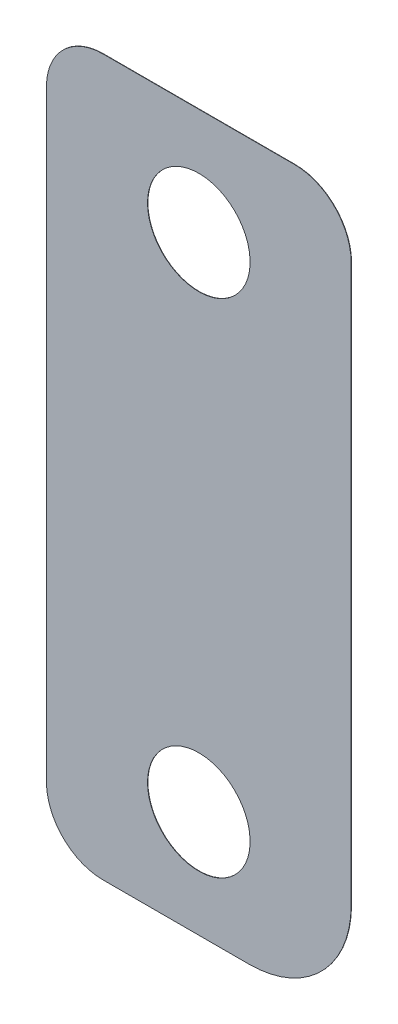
ISO-10303-21;
HEADER;
FILE_DESCRIPTION(('STEP AP214'),'2;1');
FILE_NAME('part.step','',(''),(''),'','','');
FILE_SCHEMA(('AUTOMOTIVE_DESIGN { 1 0 10303 214 1 1 1 1 }'));
ENDSEC;
DATA;
#1=APPLICATION_CONTEXT('core data for automotive mechanical design processes');
#2=APPLICATION_PROTOCOL_DEFINITION('international standard','automotive_design',2000,#1);
#3=PRODUCT_CONTEXT('',#1,'mechanical');
#4=PRODUCT('Part','Part','',(#3));
#5=PRODUCT_RELATED_PRODUCT_CATEGORY('part','',(#4));
#6=PRODUCT_DEFINITION_FORMATION('','',#4);
#7=PRODUCT_DEFINITION_CONTEXT('part definition',#1,'design');
#8=PRODUCT_DEFINITION('design','',#6,#7);
#9=PRODUCT_DEFINITION_SHAPE('','',#8);
#10=(LENGTH_UNIT() NAMED_UNIT(*) SI_UNIT(.MILLI.,.METRE.));
#11=(NAMED_UNIT(*) PLANE_ANGLE_UNIT() SI_UNIT($,.RADIAN.));
#12=(NAMED_UNIT(*) SI_UNIT($,.STERADIAN.) SOLID_ANGLE_UNIT());
#13=UNCERTAINTY_MEASURE_WITH_UNIT(LENGTH_MEASURE(1.E-05),#10,'distance_accuracy_value','');
#14=(GEOMETRIC_REPRESENTATION_CONTEXT(3) GLOBAL_UNCERTAINTY_ASSIGNED_CONTEXT((#13)) GLOBAL_UNIT_ASSIGNED_CONTEXT((#10,
#11,#12)) REPRESENTATION_CONTEXT('',''));
#15=CARTESIAN_POINT('',(0.,0.,0.));
#16=DIRECTION('',(0.,0.,1.));
#17=DIRECTION('',(1.,0.,0.));
#18=AXIS2_PLACEMENT_3D('',#15,#16,#17);
#19=CARTESIAN_POINT('',(-767.746295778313,-9.99540627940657,71.9582));
#20=DIRECTION('',(0.,0.,-1.));
#21=DIRECTION('',(-1.,0.,0.));
#22=AXIS2_PLACEMENT_3D('',#19,#20,#21);
#23=CYLINDRICAL_SURFACE('',#22,3.93700000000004);
#24=CARTESIAN_POINT('',(-767.746295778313,-9.99540627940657,71.9328));
#25=DIRECTION('',(0.,0.,-1.));
#26=DIRECTION('',(-1.,0.,0.));
#27=AXIS2_PLACEMENT_3D('',#24,#25,#26);
#28=CIRCLE('',#27,3.93700000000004);
#29=CARTESIAN_POINT('',(-771.683295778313,-9.99540627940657,71.9328));
#30=VERTEX_POINT('',#29);
#31=CARTESIAN_POINT('',(-767.746295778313,-6.05840627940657,71.9328));
#32=VERTEX_POINT('',#31);
#33=EDGE_CURVE('E149',#30,#32,#28,.T.);
#34=ORIENTED_EDGE('',*,*,#33,.F.);
#35=DIRECTION('',(0.,0.,-1.));
#36=VECTOR('',#35,1.);
#37=CARTESIAN_POINT('',(-771.683295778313,-9.99540627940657,71.9582));
#38=LINE('',#37,#36);
#39=CARTESIAN_POINT('',(-771.683295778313,-9.99540627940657,71.9582));
#40=VERTEX_POINT('',#39);
#41=EDGE_CURVE('E11',#40,#30,#38,.T.);
#42=ORIENTED_EDGE('',*,*,#41,.F.);
#43=CARTESIAN_POINT('',(-767.746295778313,-9.99540627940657,71.9582));
#44=DIRECTION('',(0.,0.,-1.));
#45=DIRECTION('',(-1.,0.,0.));
#46=AXIS2_PLACEMENT_3D('',#43,#44,#45);
#47=CIRCLE('',#46,3.93700000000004);
#48=CARTESIAN_POINT('',(-767.746295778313,-6.05840627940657,71.9582));
#49=VERTEX_POINT('',#48);
#50=EDGE_CURVE('E178',#40,#49,#47,.T.);
#51=ORIENTED_EDGE('',*,*,#50,.T.);
#52=DIRECTION('',(0.,0.,-1.));
#53=VECTOR('',#52,1.);
#54=CARTESIAN_POINT('',(-767.746295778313,-6.05840627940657,71.9582));
#55=LINE('',#54,#53);
#56=EDGE_CURVE('E48',#49,#32,#55,.T.);
#57=ORIENTED_EDGE('',*,*,#56,.T.);
#58=EDGE_LOOP('',(#34,#42,#51,#57));
#59=FACE_BOUND('',#58,.T.);
#60=ADVANCED_FACE('F45',(#59),#23,.T.);
#61=CARTESIAN_POINT('',(-771.683295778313,-51.9054062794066,71.9582));
#62=DIRECTION('',(-1.,0.,0.));
#63=DIRECTION('',(0.,0.,1.));
#64=AXIS2_PLACEMENT_3D('',#61,#62,#63);
#65=PLANE('',#64);
#66=DIRECTION('',(0.,1.,0.));
#67=VECTOR('',#66,1.);
#68=CARTESIAN_POINT('',(-771.683295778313,-51.9054062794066,71.9328));
#69=LINE('',#68,#67);
#70=CARTESIAN_POINT('',(-771.683295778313,-51.9054062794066,71.9328));
#71=VERTEX_POINT('',#70);
#72=EDGE_CURVE('E175',#71,#30,#69,.T.);
#73=ORIENTED_EDGE('',*,*,#72,.F.);
#74=DIRECTION('',(0.,0.,-1.));
#75=VECTOR('',#74,1.);
#76=CARTESIAN_POINT('',(-771.683295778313,-51.9054062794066,71.9582));
#77=LINE('',#76,#75);
#78=CARTESIAN_POINT('',(-771.683295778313,-51.9054062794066,71.9582));
#79=VERTEX_POINT('',#78);
#80=EDGE_CURVE('E55',#79,#71,#77,.T.);
#81=ORIENTED_EDGE('',*,*,#80,.F.);
#82=DIRECTION('',(0.,1.,0.));
#83=VECTOR('',#82,1.);
#84=CARTESIAN_POINT('',(-771.683295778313,-51.9054062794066,71.9582));
#85=LINE('',#84,#83);
#86=EDGE_CURVE('E134',#79,#40,#85,.T.);
#87=ORIENTED_EDGE('',*,*,#86,.T.);
#88=ORIENTED_EDGE('',*,*,#41,.T.);
#89=EDGE_LOOP('',(#73,#81,#87,#88));
#90=FACE_BOUND('',#89,.T.);
#91=ADVANCED_FACE('F198',(#90),#65,.T.);
#92=CARTESIAN_POINT('',(-767.746295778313,-51.9054062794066,71.9582));
#93=DIRECTION('',(0.,0.,-1.));
#94=DIRECTION('',(-1.,0.,0.));
#95=AXIS2_PLACEMENT_3D('',#92,#93,#94);
#96=CYLINDRICAL_SURFACE('',#95,3.93700000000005);
#97=CARTESIAN_POINT('',(-767.746295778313,-51.9054062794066,71.9328));
#98=DIRECTION('',(0.,0.,-1.));
#99=DIRECTION('',(-1.,0.,0.));
#100=AXIS2_PLACEMENT_3D('',#97,#98,#99);
#101=CIRCLE('',#100,3.93700000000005);
#102=CARTESIAN_POINT('',(-767.746295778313,-55.8424062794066,71.9328));
#103=VERTEX_POINT('',#102);
#104=EDGE_CURVE('E120',#103,#71,#101,.T.);
#105=ORIENTED_EDGE('',*,*,#104,.F.);
#106=DIRECTION('',(0.,0.,-1.));
#107=VECTOR('',#106,1.);
#108=CARTESIAN_POINT('',(-767.746295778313,-55.8424062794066,71.9582));
#109=LINE('',#108,#107);
#110=CARTESIAN_POINT('',(-767.746295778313,-55.8424062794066,71.9582));
#111=VERTEX_POINT('',#110);
#112=EDGE_CURVE('E115',#111,#103,#109,.T.);
#113=ORIENTED_EDGE('',*,*,#112,.F.);
#114=CARTESIAN_POINT('',(-767.746295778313,-51.9054062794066,71.9582));
#115=DIRECTION('',(0.,0.,-1.));
#116=DIRECTION('',(-1.,0.,0.));
#117=AXIS2_PLACEMENT_3D('',#114,#115,#116);
#118=CIRCLE('',#117,3.93700000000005);
#119=EDGE_CURVE('E118',#111,#79,#118,.T.);
#120=ORIENTED_EDGE('',*,*,#119,.T.);
#121=ORIENTED_EDGE('',*,*,#80,.T.);
#122=EDGE_LOOP('',(#105,#113,#120,#121));
#123=FACE_BOUND('',#122,.T.);
#124=ADVANCED_FACE('F117',(#123),#96,.T.);
#125=CARTESIAN_POINT('',(-757.586295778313,-55.8424062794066,71.9582));
#126=DIRECTION('',(0.,-1.,0.));
#127=DIRECTION('',(1.,0.,0.));
#128=AXIS2_PLACEMENT_3D('',#125,#126,#127);
#129=PLANE('',#128);
#130=DIRECTION('',(-1.,0.,0.));
#131=VECTOR('',#130,1.);
#132=CARTESIAN_POINT('',(-757.586295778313,-55.8424062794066,71.9328));
#133=LINE('',#132,#131);
#134=CARTESIAN_POINT('',(-757.586295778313,-55.8424062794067,71.9328));
#135=VERTEX_POINT('',#134);
#136=EDGE_CURVE('E170',#135,#103,#133,.T.);
#137=ORIENTED_EDGE('',*,*,#136,.F.);
#138=DIRECTION('',(0.,0.,-1.));
#139=VECTOR('',#138,1.);
#140=CARTESIAN_POINT('',(-757.586295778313,-55.8424062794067,71.9582));
#141=LINE('',#140,#139);
#142=CARTESIAN_POINT('',(-757.586295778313,-55.8424062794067,71.9582));
#143=VERTEX_POINT('',#142);
#144=EDGE_CURVE('E126',#143,#135,#141,.T.);
#145=ORIENTED_EDGE('',*,*,#144,.F.);
#146=DIRECTION('',(-1.,0.,0.));
#147=VECTOR('',#146,1.);
#148=CARTESIAN_POINT('',(-757.586295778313,-55.8424062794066,71.9582));
#149=LINE('',#148,#147);
#150=EDGE_CURVE('E132',#143,#111,#149,.T.);
#151=ORIENTED_EDGE('',*,*,#150,.T.);
#152=ORIENTED_EDGE('',*,*,#112,.T.);
#153=EDGE_LOOP('',(#137,#145,#151,#152));
#154=FACE_BOUND('',#153,.T.);
#155=ADVANCED_FACE('F137',(#154),#129,.T.);
#156=CARTESIAN_POINT('',(-757.586295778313,-48.7304062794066,71.9582));
#157=DIRECTION('',(0.,0.,-1.));
#158=DIRECTION('',(-1.,0.,0.));
#159=AXIS2_PLACEMENT_3D('',#156,#157,#158);
#160=CYLINDRICAL_SURFACE('',#159,7.11200000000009);
#161=CARTESIAN_POINT('',(-757.586295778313,-48.7304062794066,71.9328));
#162=DIRECTION('',(0.,0.,-1.));
#163=DIRECTION('',(-1.,0.,0.));
#164=AXIS2_PLACEMENT_3D('',#161,#162,#163);
#165=CIRCLE('',#164,7.11200000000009);
#166=CARTESIAN_POINT('',(-750.474295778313,-48.7304062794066,71.9328));
#167=VERTEX_POINT('',#166);
#168=EDGE_CURVE('E166',#167,#135,#165,.T.);
#169=ORIENTED_EDGE('',*,*,#168,.F.);
#170=DIRECTION('',(0.,0.,-1.));
#171=VECTOR('',#170,1.);
#172=CARTESIAN_POINT('',(-750.474295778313,-48.7304062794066,71.9582));
#173=LINE('',#172,#171);
#174=CARTESIAN_POINT('',(-750.474295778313,-48.7304062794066,71.9582));
#175=VERTEX_POINT('',#174);
#176=EDGE_CURVE('E184',#175,#167,#173,.T.);
#177=ORIENTED_EDGE('',*,*,#176,.F.);
#178=CARTESIAN_POINT('',(-757.586295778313,-48.7304062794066,71.9582));
#179=DIRECTION('',(0.,0.,-1.));
#180=DIRECTION('',(-1.,0.,0.));
#181=AXIS2_PLACEMENT_3D('',#178,#179,#180);
#182=CIRCLE('',#181,7.11200000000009);
#183=EDGE_CURVE('E139',#175,#143,#182,.T.);
#184=ORIENTED_EDGE('',*,*,#183,.T.);
#185=ORIENTED_EDGE('',*,*,#144,.T.);
#186=EDGE_LOOP('',(#169,#177,#184,#185));
#187=FACE_BOUND('',#186,.T.);
#188=ADVANCED_FACE('F211',(#187),#160,.T.);
#189=CARTESIAN_POINT('',(-750.474295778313,-9.99540627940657,71.9582));
#190=DIRECTION('',(1.,0.,0.));
#191=DIRECTION('',(0.,1.,0.));
#192=AXIS2_PLACEMENT_3D('',#189,#190,#191);
#193=PLANE('',#192);
#194=DIRECTION('',(0.,-1.,0.));
#195=VECTOR('',#194,1.);
#196=CARTESIAN_POINT('',(-750.474295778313,-9.99540627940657,71.9328));
#197=LINE('',#196,#195);
#198=CARTESIAN_POINT('',(-750.474295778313,-9.99540627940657,71.9328));
#199=VERTEX_POINT('',#198);
#200=EDGE_CURVE('E162',#199,#167,#197,.T.);
#201=ORIENTED_EDGE('',*,*,#200,.F.);
#202=DIRECTION('',(0.,0.,-1.));
#203=VECTOR('',#202,1.);
#204=CARTESIAN_POINT('',(-750.474295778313,-9.99540627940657,71.9582));
#205=LINE('',#204,#203);
#206=CARTESIAN_POINT('',(-750.474295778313,-9.99540627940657,71.9582));
#207=VERTEX_POINT('',#206);
#208=EDGE_CURVE('E187',#207,#199,#205,.T.);
#209=ORIENTED_EDGE('',*,*,#208,.F.);
#210=DIRECTION('',(0.,-1.,0.));
#211=VECTOR('',#210,1.);
#212=CARTESIAN_POINT('',(-750.474295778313,-9.99540627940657,71.9582));
#213=LINE('',#212,#211);
#214=EDGE_CURVE('E143',#207,#175,#213,.T.);
#215=ORIENTED_EDGE('',*,*,#214,.T.);
#216=ORIENTED_EDGE('',*,*,#176,.T.);
#217=EDGE_LOOP('',(#201,#209,#215,#216));
#218=FACE_BOUND('',#217,.T.);
#219=ADVANCED_FACE('F214',(#218),#193,.T.);
#220=CARTESIAN_POINT('',(-754.411295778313,-9.99540627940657,71.9582));
#221=DIRECTION('',(0.,0.,-1.));
#222=DIRECTION('',(-1.,0.,0.));
#223=AXIS2_PLACEMENT_3D('',#220,#221,#222);
#224=CYLINDRICAL_SURFACE('',#223,3.93699999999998);
#225=CARTESIAN_POINT('',(-754.411295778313,-9.99540627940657,71.9328));
#226=DIRECTION('',(0.,0.,-1.));
#227=DIRECTION('',(-1.,0.,0.));
#228=AXIS2_PLACEMENT_3D('',#225,#226,#227);
#229=CIRCLE('',#228,3.93699999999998);
#230=CARTESIAN_POINT('',(-754.411295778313,-6.05840627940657,71.9328));
#231=VERTEX_POINT('',#230);
#232=EDGE_CURVE('E158',#231,#199,#229,.T.);
#233=ORIENTED_EDGE('',*,*,#232,.F.);
#234=DIRECTION('',(0.,0.,-1.));
#235=VECTOR('',#234,1.);
#236=CARTESIAN_POINT('',(-754.411295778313,-6.05840627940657,71.9582));
#237=LINE('',#236,#235);
#238=CARTESIAN_POINT('',(-754.411295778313,-6.05840627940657,71.9582));
#239=VERTEX_POINT('',#238);
#240=EDGE_CURVE('E189',#239,#231,#237,.T.);
#241=ORIENTED_EDGE('',*,*,#240,.F.);
#242=CARTESIAN_POINT('',(-754.411295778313,-9.99540627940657,71.9582));
#243=DIRECTION('',(0.,0.,-1.));
#244=DIRECTION('',(-1.,0.,0.));
#245=AXIS2_PLACEMENT_3D('',#242,#243,#244);
#246=CIRCLE('',#245,3.93699999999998);
#247=EDGE_CURVE('E267',#239,#207,#246,.T.);
#248=ORIENTED_EDGE('',*,*,#247,.T.);
#249=ORIENTED_EDGE('',*,*,#208,.T.);
#250=EDGE_LOOP('',(#233,#241,#248,#249));
#251=FACE_BOUND('',#250,.T.);
#252=ADVANCED_FACE('F218',(#251),#224,.T.);
#253=CARTESIAN_POINT('',(-767.746295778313,-6.05840627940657,71.9582));
#254=DIRECTION('',(0.,1.,0.));
#255=DIRECTION('',(-1.,0.,0.));
#256=AXIS2_PLACEMENT_3D('',#253,#254,#255);
#257=PLANE('',#256);
#258=DIRECTION('',(1.,0.,0.));
#259=VECTOR('',#258,1.);
#260=CARTESIAN_POINT('',(-767.746295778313,-6.05840627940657,71.9328));
#261=LINE('',#260,#259);
#262=EDGE_CURVE('E153',#32,#231,#261,.T.);
#263=ORIENTED_EDGE('',*,*,#262,.F.);
#264=ORIENTED_EDGE('',*,*,#56,.F.);
#265=DIRECTION('',(1.,0.,0.));
#266=VECTOR('',#265,1.);
#267=CARTESIAN_POINT('',(-767.746295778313,-6.05840627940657,71.9582));
#268=LINE('',#267,#266);
#269=EDGE_CURVE('E264',#49,#239,#268,.T.);
#270=ORIENTED_EDGE('',*,*,#269,.T.);
#271=ORIENTED_EDGE('',*,*,#240,.T.);
#272=EDGE_LOOP('',(#263,#264,#270,#271));
#273=FACE_BOUND('',#272,.T.);
#274=ADVANCED_FACE('F195',(#273),#257,.T.);
#275=CARTESIAN_POINT('',(-767.746295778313,-9.99540627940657,71.9582));
#276=DIRECTION('',(0.,0.,-1.));
#277=DIRECTION('',(-1.,0.,0.));
#278=AXIS2_PLACEMENT_3D('',#275,#276,#277);
#279=PLANE('',#278);
#280=CARTESIAN_POINT('',(-761.078795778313,-13.4879062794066,71.9582));
#281=DIRECTION('',(0.,0.,-1.));
#282=DIRECTION('',(-1.,0.,0.));
#283=AXIS2_PLACEMENT_3D('',#280,#281,#282);
#284=CIRCLE('',#283,3.56869999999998);
#285=CARTESIAN_POINT('',(-764.647495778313,-13.4879062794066,71.9582));
#286=VERTEX_POINT('',#285);
#287=EDGE_CURVE('E245',#286,#286,#284,.T.);
#288=ORIENTED_EDGE('',*,*,#287,.T.);
#289=EDGE_LOOP('',(#288));
#290=FACE_BOUND('',#289,.T.);
#291=CARTESIAN_POINT('',(-761.078795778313,-48.4129062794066,71.9582));
#292=DIRECTION('',(0.,0.,-1.));
#293=DIRECTION('',(-1.,0.,0.));
#294=AXIS2_PLACEMENT_3D('',#291,#292,#293);
#295=CIRCLE('',#294,3.56869999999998);
#296=CARTESIAN_POINT('',(-764.647495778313,-48.4129062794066,71.9582));
#297=VERTEX_POINT('',#296);
#298=EDGE_CURVE('E250',#297,#297,#295,.T.);
#299=ORIENTED_EDGE('',*,*,#298,.T.);
#300=EDGE_LOOP('',(#299));
#301=FACE_BOUND('',#300,.T.);
#302=ORIENTED_EDGE('',*,*,#50,.F.);
#303=ORIENTED_EDGE('',*,*,#86,.F.);
#304=ORIENTED_EDGE('',*,*,#119,.F.);
#305=ORIENTED_EDGE('',*,*,#150,.F.);
#306=ORIENTED_EDGE('',*,*,#183,.F.);
#307=ORIENTED_EDGE('',*,*,#214,.F.);
#308=ORIENTED_EDGE('',*,*,#247,.F.);
#309=ORIENTED_EDGE('',*,*,#269,.F.);
#310=EDGE_LOOP('',(#302,#303,#304,#305,#306,#307,#308,#309));
#311=FACE_BOUND('',#310,.T.);
#312=ADVANCED_FACE('F130',(#290,#301,#311),#279,.F.);
#313=CARTESIAN_POINT('',(-767.746295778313,-9.99540627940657,71.9328));
#314=DIRECTION('',(0.,0.,-1.));
#315=DIRECTION('',(-1.,0.,0.));
#316=AXIS2_PLACEMENT_3D('',#313,#314,#315);
#317=PLANE('',#316);
#318=CARTESIAN_POINT('',(-761.078795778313,-13.4879062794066,71.9328));
#319=DIRECTION('',(0.,0.,-1.));
#320=DIRECTION('',(-1.,0.,0.));
#321=AXIS2_PLACEMENT_3D('',#318,#319,#320);
#322=CIRCLE('',#321,3.56869999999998);
#323=CARTESIAN_POINT('',(-764.647495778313,-13.4879062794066,71.9328));
#324=VERTEX_POINT('',#323);
#325=EDGE_CURVE('E248',#324,#324,#322,.T.);
#326=ORIENTED_EDGE('',*,*,#325,.F.);
#327=EDGE_LOOP('',(#326));
#328=FACE_BOUND('',#327,.T.);
#329=CARTESIAN_POINT('',(-761.078795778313,-48.4129062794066,71.9328));
#330=DIRECTION('',(0.,0.,-1.));
#331=DIRECTION('',(-1.,0.,0.));
#332=AXIS2_PLACEMENT_3D('',#329,#330,#331);
#333=CIRCLE('',#332,3.56869999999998);
#334=CARTESIAN_POINT('',(-764.647495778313,-48.4129062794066,71.9328));
#335=VERTEX_POINT('',#334);
#336=EDGE_CURVE('E154',#335,#335,#333,.T.);
#337=ORIENTED_EDGE('',*,*,#336,.F.);
#338=EDGE_LOOP('',(#337));
#339=FACE_BOUND('',#338,.T.);
#340=ORIENTED_EDGE('',*,*,#33,.T.);
#341=ORIENTED_EDGE('',*,*,#262,.T.);
#342=ORIENTED_EDGE('',*,*,#232,.T.);
#343=ORIENTED_EDGE('',*,*,#200,.T.);
#344=ORIENTED_EDGE('',*,*,#168,.T.);
#345=ORIENTED_EDGE('',*,*,#136,.T.);
#346=ORIENTED_EDGE('',*,*,#104,.T.);
#347=ORIENTED_EDGE('',*,*,#72,.T.);
#348=EDGE_LOOP('',(#340,#341,#342,#343,#344,#345,#346,#347));
#349=FACE_BOUND('',#348,.T.);
#350=ADVANCED_FACE('F197',(#328,#339,#349),#317,.T.);
#351=CARTESIAN_POINT('',(-761.078795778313,-48.4129062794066,71.9328));
#352=DIRECTION('',(0.,0.,-1.));
#353=DIRECTION('',(-1.,0.,0.));
#354=AXIS2_PLACEMENT_3D('',#351,#352,#353);
#355=CYLINDRICAL_SURFACE('',#354,3.56869999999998);
#356=ORIENTED_EDGE('',*,*,#298,.F.);
#357=EDGE_LOOP('',(#356));
#358=FACE_BOUND('',#357,.T.);
#359=ORIENTED_EDGE('',*,*,#336,.T.);
#360=EDGE_LOOP('',(#359));
#361=FACE_BOUND('',#360,.T.);
#362=ADVANCED_FACE('F230',(#358,#361),#355,.F.);
#363=CARTESIAN_POINT('',(-761.078795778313,-13.4879062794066,71.9328));
#364=DIRECTION('',(0.,0.,-1.));
#365=DIRECTION('',(-1.,0.,0.));
#366=AXIS2_PLACEMENT_3D('',#363,#364,#365);
#367=CYLINDRICAL_SURFACE('',#366,3.56869999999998);
#368=ORIENTED_EDGE('',*,*,#287,.F.);
#369=EDGE_LOOP('',(#368));
#370=FACE_BOUND('',#369,.T.);
#371=ORIENTED_EDGE('',*,*,#325,.T.);
#372=EDGE_LOOP('',(#371));
#373=FACE_BOUND('',#372,.T.);
#374=ADVANCED_FACE('F237',(#370,#373),#367,.F.);
#375=CLOSED_SHELL('',(#60,#91,#124,#155,#188,#219,#252,#274,#312,#350,#362,#374));
#376=MANIFOLD_SOLID_BREP('B2',#375);
#377=ADVANCED_BREP_SHAPE_REPRESENTATION('',(#18,#376),#14);
#378=SHAPE_DEFINITION_REPRESENTATION(#9,#377);
ENDSEC;
END-ISO-10303-21;
